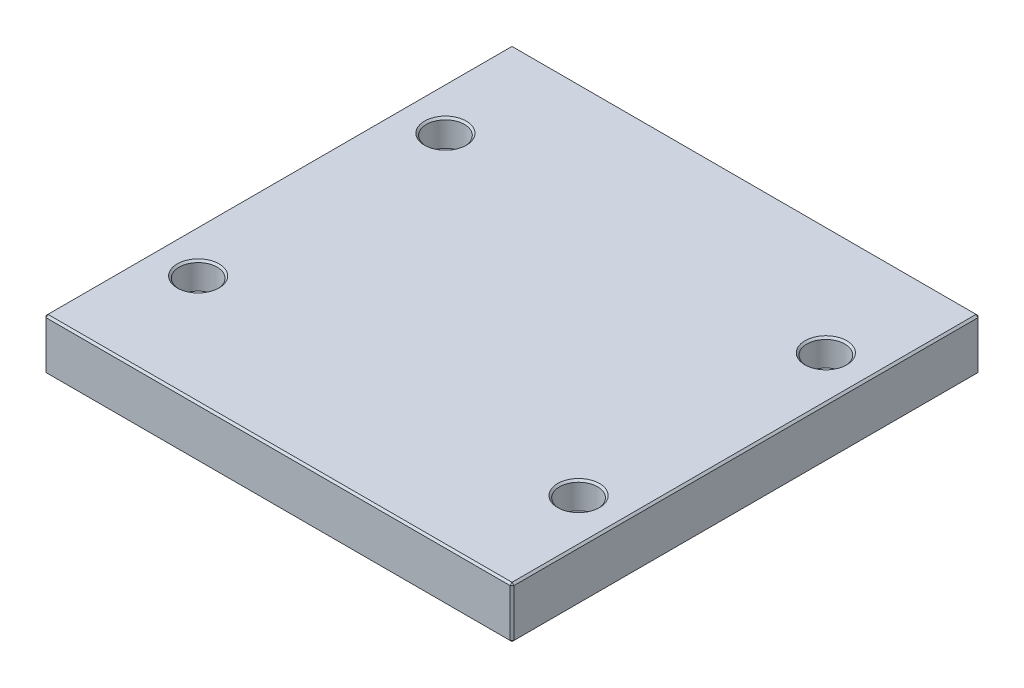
ISO-10303-21;
HEADER;
FILE_DESCRIPTION(('STEP AP214'),'2;1');
FILE_NAME('part.step','',(''),(''),'','','');
FILE_SCHEMA(('AUTOMOTIVE_DESIGN { 1 0 10303 214 1 1 1 1 }'));
ENDSEC;
DATA;
#1=APPLICATION_CONTEXT('core data for automotive mechanical design processes');
#2=APPLICATION_PROTOCOL_DEFINITION('international standard','automotive_design',2000,#1);
#3=PRODUCT_CONTEXT('',#1,'mechanical');
#4=PRODUCT('Part','Part','',(#3));
#5=PRODUCT_RELATED_PRODUCT_CATEGORY('part','',(#4));
#6=PRODUCT_DEFINITION_FORMATION('','',#4);
#7=PRODUCT_DEFINITION_CONTEXT('part definition',#1,'design');
#8=PRODUCT_DEFINITION('design','',#6,#7);
#9=PRODUCT_DEFINITION_SHAPE('','',#8);
#10=(LENGTH_UNIT() NAMED_UNIT(*) SI_UNIT(.MILLI.,.METRE.));
#11=(NAMED_UNIT(*) PLANE_ANGLE_UNIT() SI_UNIT($,.RADIAN.));
#12=(NAMED_UNIT(*) SI_UNIT($,.STERADIAN.) SOLID_ANGLE_UNIT());
#13=UNCERTAINTY_MEASURE_WITH_UNIT(LENGTH_MEASURE(1.E-05),#10,'distance_accuracy_value','');
#14=(GEOMETRIC_REPRESENTATION_CONTEXT(3) GLOBAL_UNCERTAINTY_ASSIGNED_CONTEXT((#13)) GLOBAL_UNIT_ASSIGNED_CONTEXT((#10,
#11,#12)) REPRESENTATION_CONTEXT('',''));
#15=CARTESIAN_POINT('',(0.,0.,0.));
#16=DIRECTION('',(0.,0.,1.));
#17=DIRECTION('',(1.,0.,0.));
#18=AXIS2_PLACEMENT_3D('',#15,#16,#17);
#19=CARTESIAN_POINT('',(-123.,27.,123.));
#20=DIRECTION('',(1.,0.,0.));
#21=DIRECTION('',(0.,0.,-1.));
#22=AXIS2_PLACEMENT_3D('',#19,#20,#21);
#23=PLANE('',#22);
#24=DIRECTION('',(0.,-1.,0.));
#25=VECTOR('',#24,1.);
#26=CARTESIAN_POINT('',(-123.,27.,-122.));
#27=LINE('',#26,#25);
#28=CARTESIAN_POINT('',(-123.,26.,-122.));
#29=VERTEX_POINT('',#28);
#30=CARTESIAN_POINT('',(-123.,1.,-122.));
#31=VERTEX_POINT('',#30);
#32=EDGE_CURVE('E115',#29,#31,#27,.T.);
#33=ORIENTED_EDGE('',*,*,#32,.T.);
#34=DIRECTION('',(0.,0.,1.));
#35=VECTOR('',#34,1.);
#36=CARTESIAN_POINT('',(-123.,1.,123.));
#37=LINE('',#36,#35);
#38=CARTESIAN_POINT('',(-123.,1.,122.));
#39=VERTEX_POINT('',#38);
#40=EDGE_CURVE('E111',#31,#39,#37,.T.);
#41=ORIENTED_EDGE('',*,*,#40,.T.);
#42=DIRECTION('',(0.,1.,0.));
#43=VECTOR('',#42,1.);
#44=CARTESIAN_POINT('',(-123.,27.,122.));
#45=LINE('',#44,#43);
#46=CARTESIAN_POINT('',(-123.,26.,122.));
#47=VERTEX_POINT('',#46);
#48=EDGE_CURVE('E104',#39,#47,#45,.T.);
#49=ORIENTED_EDGE('',*,*,#48,.T.);
#50=DIRECTION('',(0.,0.,-1.));
#51=VECTOR('',#50,1.);
#52=CARTESIAN_POINT('',(-123.,26.,-123.));
#53=LINE('',#52,#51);
#54=EDGE_CURVE('E108',#47,#29,#53,.T.);
#55=ORIENTED_EDGE('',*,*,#54,.T.);
#56=EDGE_LOOP('',(#33,#41,#49,#55));
#57=FACE_BOUND('',#56,.T.);
#58=ADVANCED_FACE('F16',(#57),#23,.F.);
#59=CARTESIAN_POINT('',(123.,27.,123.));
#60=DIRECTION('',(0.,0.,-1.));
#61=DIRECTION('',(-1.,0.,0.));
#62=AXIS2_PLACEMENT_3D('',#59,#60,#61);
#63=PLANE('',#62);
#64=DIRECTION('',(-1.,0.,0.));
#65=VECTOR('',#64,1.);
#66=CARTESIAN_POINT('',(-123.,26.,123.));
#67=LINE('',#66,#65);
#68=CARTESIAN_POINT('',(122.,26.,123.));
#69=VERTEX_POINT('',#68);
#70=CARTESIAN_POINT('',(-122.,26.,123.));
#71=VERTEX_POINT('',#70);
#72=EDGE_CURVE('E170',#69,#71,#67,.T.);
#73=ORIENTED_EDGE('',*,*,#72,.T.);
#74=DIRECTION('',(0.,-1.,0.));
#75=VECTOR('',#74,1.);
#76=CARTESIAN_POINT('',(-122.,27.,123.));
#77=LINE('',#76,#75);
#78=CARTESIAN_POINT('',(-122.,1.,123.));
#79=VERTEX_POINT('',#78);
#80=EDGE_CURVE('E123',#71,#79,#77,.T.);
#81=ORIENTED_EDGE('',*,*,#80,.T.);
#82=DIRECTION('',(1.,0.,0.));
#83=VECTOR('',#82,1.);
#84=CARTESIAN_POINT('',(123.,1.,123.));
#85=LINE('',#84,#83);
#86=CARTESIAN_POINT('',(122.,1.,123.));
#87=VERTEX_POINT('',#86);
#88=EDGE_CURVE('E174',#79,#87,#85,.T.);
#89=ORIENTED_EDGE('',*,*,#88,.T.);
#90=DIRECTION('',(0.,1.,0.));
#91=VECTOR('',#90,1.);
#92=CARTESIAN_POINT('',(122.,27.,123.));
#93=LINE('',#92,#91);
#94=EDGE_CURVE('E172',#87,#69,#93,.T.);
#95=ORIENTED_EDGE('',*,*,#94,.T.);
#96=EDGE_LOOP('',(#73,#81,#89,#95));
#97=FACE_BOUND('',#96,.T.);
#98=ADVANCED_FACE('F317',(#97),#63,.F.);
#99=CARTESIAN_POINT('',(123.,27.,123.));
#100=DIRECTION('',(-1.,0.,0.));
#101=DIRECTION('',(0.,0.,1.));
#102=AXIS2_PLACEMENT_3D('',#99,#100,#101);
#103=PLANE('',#102);
#104=DIRECTION('',(0.,0.,-1.));
#105=VECTOR('',#104,1.);
#106=CARTESIAN_POINT('',(123.,1.,123.));
#107=LINE('',#106,#105);
#108=CARTESIAN_POINT('',(123.,1.,122.));
#109=VERTEX_POINT('',#108);
#110=CARTESIAN_POINT('',(123.,1.,-122.));
#111=VERTEX_POINT('',#110);
#112=EDGE_CURVE('E165',#109,#111,#107,.T.);
#113=ORIENTED_EDGE('',*,*,#112,.T.);
#114=DIRECTION('',(0.,1.,0.));
#115=VECTOR('',#114,1.);
#116=CARTESIAN_POINT('',(123.,27.,-122.));
#117=LINE('',#116,#115);
#118=CARTESIAN_POINT('',(123.,26.,-122.));
#119=VERTEX_POINT('',#118);
#120=EDGE_CURVE('E167',#111,#119,#117,.T.);
#121=ORIENTED_EDGE('',*,*,#120,.T.);
#122=DIRECTION('',(0.,0.,1.));
#123=VECTOR('',#122,1.);
#124=CARTESIAN_POINT('',(123.,26.,123.));
#125=LINE('',#124,#123);
#126=CARTESIAN_POINT('',(123.,26.,122.));
#127=VERTEX_POINT('',#126);
#128=EDGE_CURVE('E161',#119,#127,#125,.T.);
#129=ORIENTED_EDGE('',*,*,#128,.T.);
#130=DIRECTION('',(0.,-1.,0.));
#131=VECTOR('',#130,1.);
#132=CARTESIAN_POINT('',(123.,27.,122.));
#133=LINE('',#132,#131);
#134=EDGE_CURVE('E163',#127,#109,#133,.T.);
#135=ORIENTED_EDGE('',*,*,#134,.T.);
#136=EDGE_LOOP('',(#113,#121,#129,#135));
#137=FACE_BOUND('',#136,.T.);
#138=ADVANCED_FACE('F323',(#137),#103,.F.);
#139=CARTESIAN_POINT('',(123.,27.,-123.));
#140=DIRECTION('',(0.,0.,1.));
#141=DIRECTION('',(1.,0.,0.));
#142=AXIS2_PLACEMENT_3D('',#139,#140,#141);
#143=PLANE('',#142);
#144=DIRECTION('',(0.,-1.,0.));
#145=VECTOR('',#144,1.);
#146=CARTESIAN_POINT('',(122.,27.,-123.));
#147=LINE('',#146,#145);
#148=CARTESIAN_POINT('',(122.,26.,-123.));
#149=VERTEX_POINT('',#148);
#150=CARTESIAN_POINT('',(122.,1.,-123.));
#151=VERTEX_POINT('',#150);
#152=EDGE_CURVE('E154',#149,#151,#147,.T.);
#153=ORIENTED_EDGE('',*,*,#152,.T.);
#154=DIRECTION('',(-1.,0.,0.));
#155=VECTOR('',#154,1.);
#156=CARTESIAN_POINT('',(123.,1.,-123.));
#157=LINE('',#156,#155);
#158=CARTESIAN_POINT('',(-122.,1.,-123.));
#159=VERTEX_POINT('',#158);
#160=EDGE_CURVE('E159',#151,#159,#157,.T.);
#161=ORIENTED_EDGE('',*,*,#160,.T.);
#162=DIRECTION('',(0.,1.,0.));
#163=VECTOR('',#162,1.);
#164=CARTESIAN_POINT('',(-122.,27.,-123.));
#165=LINE('',#164,#163);
#166=CARTESIAN_POINT('',(-122.,26.,-123.));
#167=VERTEX_POINT('',#166);
#168=EDGE_CURVE('E156',#159,#167,#165,.T.);
#169=ORIENTED_EDGE('',*,*,#168,.T.);
#170=DIRECTION('',(1.,0.,0.));
#171=VECTOR('',#170,1.);
#172=CARTESIAN_POINT('',(123.,26.,-123.));
#173=LINE('',#172,#171);
#174=EDGE_CURVE('E152',#167,#149,#173,.T.);
#175=ORIENTED_EDGE('',*,*,#174,.T.);
#176=EDGE_LOOP('',(#153,#161,#169,#175));
#177=FACE_BOUND('',#176,.T.);
#178=ADVANCED_FACE('F465',(#177),#143,.F.);
#179=CARTESIAN_POINT('',(0.,27.,0.));
#180=DIRECTION('',(0.,1.,0.));
#181=DIRECTION('',(0.,0.,1.));
#182=AXIS2_PLACEMENT_3D('',#179,#180,#181);
#183=PLANE('',#182);
#184=CARTESIAN_POINT('',(-100.,27.,65.));
#185=DIRECTION('',(0.,1.,0.));
#186=DIRECTION('',(0.,0.,1.));
#187=AXIS2_PLACEMENT_3D('',#184,#185,#186);
#188=CIRCLE('',#187,11.);
#189=CARTESIAN_POINT('',(-100.,27.,76.));
#190=VERTEX_POINT('',#189);
#191=EDGE_CURVE('E290',#190,#190,#188,.F.);
#192=ORIENTED_EDGE('',*,*,#191,.T.);
#193=EDGE_LOOP('',(#192));
#194=FACE_BOUND('',#193,.T.);
#195=CARTESIAN_POINT('',(100.,27.,65.));
#196=DIRECTION('',(0.,1.,0.));
#197=DIRECTION('',(0.,0.,1.));
#198=AXIS2_PLACEMENT_3D('',#195,#196,#197);
#199=CIRCLE('',#198,11.);
#200=CARTESIAN_POINT('',(100.,27.,76.));
#201=VERTEX_POINT('',#200);
#202=EDGE_CURVE('E287',#201,#201,#199,.F.);
#203=ORIENTED_EDGE('',*,*,#202,.T.);
#204=EDGE_LOOP('',(#203));
#205=FACE_BOUND('',#204,.T.);
#206=CARTESIAN_POINT('',(100.,27.,-65.));
#207=DIRECTION('',(0.,1.,0.));
#208=DIRECTION('',(0.,0.,1.));
#209=AXIS2_PLACEMENT_3D('',#206,#207,#208);
#210=CIRCLE('',#209,11.);
#211=CARTESIAN_POINT('',(100.,27.,-54.));
#212=VERTEX_POINT('',#211);
#213=EDGE_CURVE('E284',#212,#212,#210,.F.);
#214=ORIENTED_EDGE('',*,*,#213,.T.);
#215=EDGE_LOOP('',(#214));
#216=FACE_BOUND('',#215,.T.);
#217=CARTESIAN_POINT('',(-100.,27.,-65.));
#218=DIRECTION('',(0.,1.,0.));
#219=DIRECTION('',(0.,0.,1.));
#220=AXIS2_PLACEMENT_3D('',#217,#218,#219);
#221=CIRCLE('',#220,11.);
#222=CARTESIAN_POINT('',(-100.,27.,-54.));
#223=VERTEX_POINT('',#222);
#224=EDGE_CURVE('E281',#223,#223,#221,.F.);
#225=ORIENTED_EDGE('',*,*,#224,.T.);
#226=EDGE_LOOP('',(#225));
#227=FACE_BOUND('',#226,.T.);
#228=DIRECTION('',(0.,0.,-1.));
#229=VECTOR('',#228,1.);
#230=CARTESIAN_POINT('',(122.,27.,-123.));
#231=LINE('',#230,#229);
#232=CARTESIAN_POINT('',(122.,27.,122.));
#233=VERTEX_POINT('',#232);
#234=CARTESIAN_POINT('',(122.,27.,-122.));
#235=VERTEX_POINT('',#234);
#236=EDGE_CURVE('E31',#233,#235,#231,.T.);
#237=ORIENTED_EDGE('',*,*,#236,.T.);
#238=DIRECTION('',(-1.,0.,0.));
#239=VECTOR('',#238,1.);
#240=CARTESIAN_POINT('',(-123.,27.,-122.));
#241=LINE('',#240,#239);
#242=CARTESIAN_POINT('',(-122.,27.,-122.));
#243=VERTEX_POINT('',#242);
#244=EDGE_CURVE('E190',#235,#243,#241,.T.);
#245=ORIENTED_EDGE('',*,*,#244,.T.);
#246=DIRECTION('',(0.,0.,1.));
#247=VECTOR('',#246,1.);
#248=CARTESIAN_POINT('',(-122.,27.,123.));
#249=LINE('',#248,#247);
#250=CARTESIAN_POINT('',(-122.,27.,122.));
#251=VERTEX_POINT('',#250);
#252=EDGE_CURVE('E186',#243,#251,#249,.T.);
#253=ORIENTED_EDGE('',*,*,#252,.T.);
#254=DIRECTION('',(1.,0.,0.));
#255=VECTOR('',#254,1.);
#256=CARTESIAN_POINT('',(123.,27.,122.));
#257=LINE('',#256,#255);
#258=EDGE_CURVE('E36',#251,#233,#257,.T.);
#259=ORIENTED_EDGE('',*,*,#258,.T.);
#260=EDGE_LOOP('',(#237,#245,#253,#259));
#261=FACE_BOUND('',#260,.T.);
#262=ADVANCED_FACE('F462',(#194,#205,#216,#227,#261),#183,.T.);
#263=CARTESIAN_POINT('',(0.,0.,0.));
#264=DIRECTION('',(0.,1.,0.));
#265=DIRECTION('',(0.,0.,1.));
#266=AXIS2_PLACEMENT_3D('',#263,#264,#265);
#267=PLANE('',#266);
#268=CARTESIAN_POINT('',(100.,0.,-65.));
#269=DIRECTION('',(0.,1.,0.));
#270=DIRECTION('',(0.,0.,1.));
#271=AXIS2_PLACEMENT_3D('',#268,#269,#270);
#272=CIRCLE('',#271,8.);
#273=CARTESIAN_POINT('',(100.,0.,-57.));
#274=VERTEX_POINT('',#273);
#275=EDGE_CURVE('E263',#274,#274,#272,.T.);
#276=ORIENTED_EDGE('',*,*,#275,.T.);
#277=EDGE_LOOP('',(#276));
#278=FACE_BOUND('',#277,.T.);
#279=CARTESIAN_POINT('',(100.,0.,65.));
#280=DIRECTION('',(0.,1.,0.));
#281=DIRECTION('',(0.,0.,1.));
#282=AXIS2_PLACEMENT_3D('',#279,#280,#281);
#283=CIRCLE('',#282,8.);
#284=CARTESIAN_POINT('',(100.,0.,73.));
#285=VERTEX_POINT('',#284);
#286=EDGE_CURVE('E260',#285,#285,#283,.T.);
#287=ORIENTED_EDGE('',*,*,#286,.T.);
#288=EDGE_LOOP('',(#287));
#289=FACE_BOUND('',#288,.T.);
#290=CARTESIAN_POINT('',(-100.,0.,65.));
#291=DIRECTION('',(0.,1.,0.));
#292=DIRECTION('',(0.,0.,1.));
#293=AXIS2_PLACEMENT_3D('',#290,#291,#292);
#294=CIRCLE('',#293,8.);
#295=CARTESIAN_POINT('',(-100.,0.,73.));
#296=VERTEX_POINT('',#295);
#297=EDGE_CURVE('E257',#296,#296,#294,.T.);
#298=ORIENTED_EDGE('',*,*,#297,.T.);
#299=EDGE_LOOP('',(#298));
#300=FACE_BOUND('',#299,.T.);
#301=CARTESIAN_POINT('',(-100.,0.,-65.));
#302=DIRECTION('',(0.,1.,0.));
#303=DIRECTION('',(0.,0.,1.));
#304=AXIS2_PLACEMENT_3D('',#301,#302,#303);
#305=CIRCLE('',#304,8.);
#306=CARTESIAN_POINT('',(-100.,0.,-57.));
#307=VERTEX_POINT('',#306);
#308=EDGE_CURVE('E192',#307,#307,#305,.T.);
#309=ORIENTED_EDGE('',*,*,#308,.T.);
#310=EDGE_LOOP('',(#309));
#311=FACE_BOUND('',#310,.T.);
#312=DIRECTION('',(0.,0.,1.));
#313=VECTOR('',#312,1.);
#314=CARTESIAN_POINT('',(122.,0.,0.));
#315=LINE('',#314,#313);
#316=CARTESIAN_POINT('',(122.,0.,-122.));
#317=VERTEX_POINT('',#316);
#318=CARTESIAN_POINT('',(122.,0.,122.));
#319=VERTEX_POINT('',#318);
#320=EDGE_CURVE('E177',#317,#319,#315,.T.);
#321=ORIENTED_EDGE('',*,*,#320,.T.);
#322=DIRECTION('',(-1.,0.,0.));
#323=VECTOR('',#322,1.);
#324=CARTESIAN_POINT('',(0.,0.,122.));
#325=LINE('',#324,#323);
#326=CARTESIAN_POINT('',(-122.,0.,122.));
#327=VERTEX_POINT('',#326);
#328=EDGE_CURVE('E183',#319,#327,#325,.T.);
#329=ORIENTED_EDGE('',*,*,#328,.T.);
#330=DIRECTION('',(0.,0.,-1.));
#331=VECTOR('',#330,1.);
#332=CARTESIAN_POINT('',(-122.,0.,0.));
#333=LINE('',#332,#331);
#334=CARTESIAN_POINT('',(-122.,0.,-122.));
#335=VERTEX_POINT('',#334);
#336=EDGE_CURVE('E181',#327,#335,#333,.T.);
#337=ORIENTED_EDGE('',*,*,#336,.T.);
#338=DIRECTION('',(1.,0.,0.));
#339=VECTOR('',#338,1.);
#340=CARTESIAN_POINT('',(0.,0.,-122.));
#341=LINE('',#340,#339);
#342=EDGE_CURVE('E179',#335,#317,#341,.T.);
#343=ORIENTED_EDGE('',*,*,#342,.T.);
#344=EDGE_LOOP('',(#321,#329,#337,#343));
#345=FACE_BOUND('',#344,.T.);
#346=ADVANCED_FACE('F402',(#278,#289,#300,#311,#345),#267,.F.);
#347=CARTESIAN_POINT('',(123.,27.,122.));
#348=DIRECTION('',(-0.707106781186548,0.,-0.707106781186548));
#349=DIRECTION('',(0.,-1.,0.));
#350=AXIS2_PLACEMENT_3D('',#347,#348,#349);
#351=PLANE('',#350);
#352=DIRECTION('',(-0.707106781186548,0.,0.707106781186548));
#353=VECTOR('',#352,1.);
#354=CARTESIAN_POINT('',(122.,26.,123.));
#355=LINE('',#354,#353);
#356=EDGE_CURVE('E141',#69,#127,#355,.F.);
#357=ORIENTED_EDGE('',*,*,#356,.F.);
#358=ORIENTED_EDGE('',*,*,#94,.F.);
#359=DIRECTION('',(0.707106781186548,0.,-0.707106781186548));
#360=VECTOR('',#359,1.);
#361=CARTESIAN_POINT('',(122.,1.,123.));
#362=LINE('',#361,#360);
#363=EDGE_CURVE('E144',#109,#87,#362,.F.);
#364=ORIENTED_EDGE('',*,*,#363,.F.);
#365=ORIENTED_EDGE('',*,*,#134,.F.);
#366=EDGE_LOOP('',(#357,#358,#364,#365));
#367=FACE_BOUND('',#366,.T.);
#368=ADVANCED_FACE('F398',(#367),#351,.F.);
#369=CARTESIAN_POINT('',(122.,26.,123.));
#370=DIRECTION('',(0.577350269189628,0.57735026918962,0.577350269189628));
#371=DIRECTION('',(0.707106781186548,0.,-0.707106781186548));
#372=AXIS2_PLACEMENT_3D('',#369,#370,#371);
#373=PLANE('',#372);
#374=DIRECTION('',(0.,-0.70710678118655,0.707106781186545));
#375=VECTOR('',#374,1.);
#376=CARTESIAN_POINT('',(122.,26.,123.));
#377=LINE('',#376,#375);
#378=EDGE_CURVE('E235',#69,#233,#377,.F.);
#379=ORIENTED_EDGE('',*,*,#378,.F.);
#380=ORIENTED_EDGE('',*,*,#356,.T.);
#381=DIRECTION('',(-0.707106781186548,0.707106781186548,0.));
#382=VECTOR('',#381,1.);
#383=CARTESIAN_POINT('',(122.5,26.5,122.));
#384=LINE('',#383,#382);
#385=EDGE_CURVE('E237',#233,#127,#384,.F.);
#386=ORIENTED_EDGE('',*,*,#385,.F.);
#387=EDGE_LOOP('',(#379,#380,#386));
#388=FACE_BOUND('',#387,.T.);
#389=ADVANCED_FACE('F394',(#388),#373,.T.);
#390=CARTESIAN_POINT('',(122.,1.,123.));
#391=DIRECTION('',(0.577350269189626,-0.577350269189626,0.577350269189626));
#392=DIRECTION('',(0.707106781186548,0.,-0.707106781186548));
#393=AXIS2_PLACEMENT_3D('',#390,#391,#392);
#394=PLANE('',#393);
#395=DIRECTION('',(-0.707106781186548,-0.707106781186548,0.));
#396=VECTOR('',#395,1.);
#397=CARTESIAN_POINT('',(122.5,0.5,122.));
#398=LINE('',#397,#396);
#399=EDGE_CURVE('E229',#109,#319,#398,.T.);
#400=ORIENTED_EDGE('',*,*,#399,.F.);
#401=ORIENTED_EDGE('',*,*,#363,.T.);
#402=DIRECTION('',(0.,0.70710678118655,0.707106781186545));
#403=VECTOR('',#402,1.);
#404=CARTESIAN_POINT('',(122.,1.,123.));
#405=LINE('',#404,#403);
#406=EDGE_CURVE('E232',#319,#87,#405,.T.);
#407=ORIENTED_EDGE('',*,*,#406,.F.);
#408=EDGE_LOOP('',(#400,#401,#407));
#409=FACE_BOUND('',#408,.T.);
#410=ADVANCED_FACE('F390',(#409),#394,.T.);
#411=CARTESIAN_POINT('',(122.,27.,0.));
#412=DIRECTION('',(0.707106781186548,0.707106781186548,0.));
#413=DIRECTION('',(0.,0.,1.));
#414=AXIS2_PLACEMENT_3D('',#411,#412,#413);
#415=PLANE('',#414);
#416=ORIENTED_EDGE('',*,*,#385,.T.);
#417=ORIENTED_EDGE('',*,*,#128,.F.);
#418=DIRECTION('',(0.707106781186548,-0.707106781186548,0.));
#419=VECTOR('',#418,1.);
#420=CARTESIAN_POINT('',(123.,26.,-122.));
#421=LINE('',#420,#419);
#422=EDGE_CURVE('E224',#235,#119,#421,.T.);
#423=ORIENTED_EDGE('',*,*,#422,.F.);
#424=ORIENTED_EDGE('',*,*,#236,.F.);
#425=EDGE_LOOP('',(#416,#417,#423,#424));
#426=FACE_BOUND('',#425,.T.);
#427=ADVANCED_FACE('F386',(#426),#415,.T.);
#428=CARTESIAN_POINT('',(0.,27.,122.));
#429=DIRECTION('',(0.,0.707106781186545,0.70710678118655));
#430=DIRECTION('',(-1.,0.,0.));
#431=AXIS2_PLACEMENT_3D('',#428,#429,#430);
#432=PLANE('',#431);
#433=ORIENTED_EDGE('',*,*,#378,.T.);
#434=ORIENTED_EDGE('',*,*,#258,.F.);
#435=DIRECTION('',(0.,0.70710678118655,-0.707106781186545));
#436=VECTOR('',#435,1.);
#437=CARTESIAN_POINT('',(-122.,26.5,122.5));
#438=LINE('',#437,#436);
#439=EDGE_CURVE('E127',#71,#251,#438,.T.);
#440=ORIENTED_EDGE('',*,*,#439,.F.);
#441=ORIENTED_EDGE('',*,*,#72,.F.);
#442=EDGE_LOOP('',(#433,#434,#440,#441));
#443=FACE_BOUND('',#442,.T.);
#444=ADVANCED_FACE('F383',(#443),#432,.T.);
#445=CARTESIAN_POINT('',(-122.,27.,123.));
#446=DIRECTION('',(0.707106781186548,0.,-0.707106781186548));
#447=DIRECTION('',(0.,-1.,0.));
#448=AXIS2_PLACEMENT_3D('',#445,#446,#447);
#449=PLANE('',#448);
#450=DIRECTION('',(0.707106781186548,0.,0.707106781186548));
#451=VECTOR('',#450,1.);
#452=CARTESIAN_POINT('',(-122.,1.,123.));
#453=LINE('',#452,#451);
#454=EDGE_CURVE('E128',#79,#39,#453,.F.);
#455=ORIENTED_EDGE('',*,*,#454,.F.);
#456=ORIENTED_EDGE('',*,*,#80,.F.);
#457=DIRECTION('',(-0.707106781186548,0.,-0.707106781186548));
#458=VECTOR('',#457,1.);
#459=CARTESIAN_POINT('',(-123.,26.,122.));
#460=LINE('',#459,#458);
#461=EDGE_CURVE('E119',#47,#71,#460,.F.);
#462=ORIENTED_EDGE('',*,*,#461,.F.);
#463=ORIENTED_EDGE('',*,*,#48,.F.);
#464=EDGE_LOOP('',(#455,#456,#462,#463));
#465=FACE_BOUND('',#464,.T.);
#466=ADVANCED_FACE('F121',(#465),#449,.F.);
#467=CARTESIAN_POINT('',(123.,1.,123.));
#468=DIRECTION('',(0.,0.707106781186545,-0.70710678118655));
#469=DIRECTION('',(1.,0.,0.));
#470=AXIS2_PLACEMENT_3D('',#467,#468,#469);
#471=PLANE('',#470);
#472=ORIENTED_EDGE('',*,*,#406,.T.);
#473=ORIENTED_EDGE('',*,*,#88,.F.);
#474=DIRECTION('',(0.,-0.70710678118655,-0.707106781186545));
#475=VECTOR('',#474,1.);
#476=CARTESIAN_POINT('',(-122.,1.,123.));
#477=LINE('',#476,#475);
#478=EDGE_CURVE('E220',#327,#79,#477,.F.);
#479=ORIENTED_EDGE('',*,*,#478,.F.);
#480=ORIENTED_EDGE('',*,*,#328,.F.);
#481=EDGE_LOOP('',(#472,#473,#479,#480));
#482=FACE_BOUND('',#481,.T.);
#483=ADVANCED_FACE('F376',(#482),#471,.F.);
#484=CARTESIAN_POINT('',(123.,1.,123.));
#485=DIRECTION('',(-0.707106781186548,0.707106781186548,0.));
#486=DIRECTION('',(0.,0.,-1.));
#487=AXIS2_PLACEMENT_3D('',#484,#485,#486);
#488=PLANE('',#487);
#489=ORIENTED_EDGE('',*,*,#399,.T.);
#490=ORIENTED_EDGE('',*,*,#320,.F.);
#491=DIRECTION('',(0.707106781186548,0.707106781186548,0.));
#492=VECTOR('',#491,1.);
#493=CARTESIAN_POINT('',(122.5,0.499999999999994,-122.));
#494=LINE('',#493,#492);
#495=EDGE_CURVE('E217',#111,#317,#494,.F.);
#496=ORIENTED_EDGE('',*,*,#495,.F.);
#497=ORIENTED_EDGE('',*,*,#112,.F.);
#498=EDGE_LOOP('',(#489,#490,#496,#497));
#499=FACE_BOUND('',#498,.T.);
#500=ADVANCED_FACE('F372',(#499),#488,.F.);
#501=CARTESIAN_POINT('',(122.,27.,-123.));
#502=DIRECTION('',(-0.707106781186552,0.,0.707106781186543));
#503=DIRECTION('',(0.,-1.,0.));
#504=AXIS2_PLACEMENT_3D('',#501,#502,#503);
#505=PLANE('',#504);
#506=DIRECTION('',(0.707106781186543,0.,0.707106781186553));
#507=VECTOR('',#506,1.);
#508=CARTESIAN_POINT('',(123.,26.,-122.));
#509=LINE('',#508,#507);
#510=EDGE_CURVE('E226',#119,#149,#509,.F.);
#511=ORIENTED_EDGE('',*,*,#510,.F.);
#512=ORIENTED_EDGE('',*,*,#120,.F.);
#513=DIRECTION('',(-0.707106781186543,0.,-0.707106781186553));
#514=VECTOR('',#513,1.);
#515=CARTESIAN_POINT('',(122.,1.,-123.));
#516=LINE('',#515,#514);
#517=EDGE_CURVE('E214',#151,#111,#516,.F.);
#518=ORIENTED_EDGE('',*,*,#517,.F.);
#519=ORIENTED_EDGE('',*,*,#152,.F.);
#520=EDGE_LOOP('',(#511,#512,#518,#519));
#521=FACE_BOUND('',#520,.T.);
#522=ADVANCED_FACE('F368',(#521),#505,.F.);
#523=CARTESIAN_POINT('',(123.,26.,-122.));
#524=DIRECTION('',(0.577350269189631,0.577350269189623,-0.577350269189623));
#525=DIRECTION('',(-0.707106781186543,0.,-0.707106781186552));
#526=AXIS2_PLACEMENT_3D('',#523,#524,#525);
#527=PLANE('',#526);
#528=ORIENTED_EDGE('',*,*,#422,.T.);
#529=ORIENTED_EDGE('',*,*,#510,.T.);
#530=DIRECTION('',(0.,0.707106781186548,0.707106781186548));
#531=VECTOR('',#530,1.);
#532=CARTESIAN_POINT('',(122.,26.5,-122.5));
#533=LINE('',#532,#531);
#534=EDGE_CURVE('E135',#235,#149,#533,.F.);
#535=ORIENTED_EDGE('',*,*,#534,.F.);
#536=EDGE_LOOP('',(#528,#529,#535));
#537=FACE_BOUND('',#536,.T.);
#538=ADVANCED_FACE('F365',(#537),#527,.T.);
#539=CARTESIAN_POINT('',(-123.,26.,122.));
#540=DIRECTION('',(-0.577350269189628,0.57735026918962,0.577350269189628));
#541=DIRECTION('',(0.707106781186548,0.,0.707106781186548));
#542=AXIS2_PLACEMENT_3D('',#539,#540,#541);
#543=PLANE('',#542);
#544=ORIENTED_EDGE('',*,*,#461,.T.);
#545=ORIENTED_EDGE('',*,*,#439,.T.);
#546=DIRECTION('',(-0.707106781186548,-0.707106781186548,0.));
#547=VECTOR('',#546,1.);
#548=CARTESIAN_POINT('',(-123.,26.,122.));
#549=LINE('',#548,#547);
#550=EDGE_CURVE('E131',#47,#251,#549,.F.);
#551=ORIENTED_EDGE('',*,*,#550,.F.);
#552=EDGE_LOOP('',(#544,#545,#551));
#553=FACE_BOUND('',#552,.T.);
#554=ADVANCED_FACE('F132',(#553),#543,.T.);
#555=CARTESIAN_POINT('',(-122.,1.,123.));
#556=DIRECTION('',(-0.577350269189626,-0.577350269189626,0.577350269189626));
#557=DIRECTION('',(0.707106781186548,0.,0.707106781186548));
#558=AXIS2_PLACEMENT_3D('',#555,#556,#557);
#559=PLANE('',#558);
#560=ORIENTED_EDGE('',*,*,#478,.T.);
#561=ORIENTED_EDGE('',*,*,#454,.T.);
#562=DIRECTION('',(-0.707106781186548,0.707106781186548,0.));
#563=VECTOR('',#562,1.);
#564=CARTESIAN_POINT('',(-122.5,0.5,122.));
#565=LINE('',#564,#563);
#566=EDGE_CURVE('E136',#327,#39,#565,.T.);
#567=ORIENTED_EDGE('',*,*,#566,.F.);
#568=EDGE_LOOP('',(#560,#561,#567));
#569=FACE_BOUND('',#568,.T.);
#570=ADVANCED_FACE('F358',(#569),#559,.T.);
#571=CARTESIAN_POINT('',(122.,1.,-123.));
#572=DIRECTION('',(0.577350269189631,-0.577350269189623,-0.577350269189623));
#573=DIRECTION('',(-0.707106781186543,0.,-0.707106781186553));
#574=AXIS2_PLACEMENT_3D('',#571,#572,#573);
#575=PLANE('',#574);
#576=ORIENTED_EDGE('',*,*,#517,.T.);
#577=ORIENTED_EDGE('',*,*,#495,.T.);
#578=DIRECTION('',(0.,-0.707106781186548,0.707106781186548));
#579=VECTOR('',#578,1.);
#580=CARTESIAN_POINT('',(122.,1.,-123.));
#581=LINE('',#580,#579);
#582=EDGE_CURVE('E207',#151,#317,#581,.T.);
#583=ORIENTED_EDGE('',*,*,#582,.F.);
#584=EDGE_LOOP('',(#576,#577,#583));
#585=FACE_BOUND('',#584,.T.);
#586=ADVANCED_FACE('F354',(#585),#575,.T.);
#587=CARTESIAN_POINT('',(0.,27.,-122.));
#588=DIRECTION('',(0.,0.707106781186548,-0.707106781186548));
#589=DIRECTION('',(1.,0.,0.));
#590=AXIS2_PLACEMENT_3D('',#587,#588,#589);
#591=PLANE('',#590);
#592=ORIENTED_EDGE('',*,*,#534,.T.);
#593=ORIENTED_EDGE('',*,*,#174,.F.);
#594=DIRECTION('',(0.,-0.707106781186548,-0.707106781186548));
#595=VECTOR('',#594,1.);
#596=CARTESIAN_POINT('',(-122.,26.,-123.));
#597=LINE('',#596,#595);
#598=EDGE_CURVE('E204',#243,#167,#597,.T.);
#599=ORIENTED_EDGE('',*,*,#598,.F.);
#600=ORIENTED_EDGE('',*,*,#244,.F.);
#601=EDGE_LOOP('',(#592,#593,#599,#600));
#602=FACE_BOUND('',#601,.T.);
#603=ADVANCED_FACE('F351',(#602),#591,.T.);
#604=CARTESIAN_POINT('',(-122.,27.,0.));
#605=DIRECTION('',(-0.707106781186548,0.707106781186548,0.));
#606=DIRECTION('',(0.,0.,-1.));
#607=AXIS2_PLACEMENT_3D('',#604,#605,#606);
#608=PLANE('',#607);
#609=ORIENTED_EDGE('',*,*,#550,.T.);
#610=ORIENTED_EDGE('',*,*,#252,.F.);
#611=DIRECTION('',(0.707106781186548,0.707106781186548,0.));
#612=VECTOR('',#611,1.);
#613=CARTESIAN_POINT('',(-122.5,26.5,-122.));
#614=LINE('',#613,#612);
#615=EDGE_CURVE('E139',#29,#243,#614,.T.);
#616=ORIENTED_EDGE('',*,*,#615,.F.);
#617=ORIENTED_EDGE('',*,*,#54,.F.);
#618=EDGE_LOOP('',(#609,#610,#616,#617));
#619=FACE_BOUND('',#618,.T.);
#620=ADVANCED_FACE('F138',(#619),#608,.T.);
#621=CARTESIAN_POINT('',(-123.,1.,123.));
#622=DIRECTION('',(0.707106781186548,0.707106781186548,0.));
#623=DIRECTION('',(0.,0.,1.));
#624=AXIS2_PLACEMENT_3D('',#621,#622,#623);
#625=PLANE('',#624);
#626=ORIENTED_EDGE('',*,*,#566,.T.);
#627=ORIENTED_EDGE('',*,*,#40,.F.);
#628=DIRECTION('',(0.707106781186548,-0.707106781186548,0.));
#629=VECTOR('',#628,1.);
#630=CARTESIAN_POINT('',(-123.,1.,-122.));
#631=LINE('',#630,#629);
#632=EDGE_CURVE('E200',#335,#31,#631,.F.);
#633=ORIENTED_EDGE('',*,*,#632,.F.);
#634=ORIENTED_EDGE('',*,*,#336,.F.);
#635=EDGE_LOOP('',(#626,#627,#633,#634));
#636=FACE_BOUND('',#635,.T.);
#637=ADVANCED_FACE('F344',(#636),#625,.F.);
#638=CARTESIAN_POINT('',(123.,1.,-123.));
#639=DIRECTION('',(0.,0.707106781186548,0.707106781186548));
#640=DIRECTION('',(-1.,0.,0.));
#641=AXIS2_PLACEMENT_3D('',#638,#639,#640);
#642=PLANE('',#641);
#643=ORIENTED_EDGE('',*,*,#582,.T.);
#644=ORIENTED_EDGE('',*,*,#342,.F.);
#645=DIRECTION('',(0.,0.707106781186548,-0.707106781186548));
#646=VECTOR('',#645,1.);
#647=CARTESIAN_POINT('',(-122.,0.5,-122.5));
#648=LINE('',#647,#646);
#649=EDGE_CURVE('E197',#159,#335,#648,.F.);
#650=ORIENTED_EDGE('',*,*,#649,.F.);
#651=ORIENTED_EDGE('',*,*,#160,.F.);
#652=EDGE_LOOP('',(#643,#644,#650,#651));
#653=FACE_BOUND('',#652,.T.);
#654=ADVANCED_FACE('F340',(#653),#642,.F.);
#655=CARTESIAN_POINT('',(-122.,26.,-123.));
#656=DIRECTION('',(-0.577350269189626,0.577350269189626,-0.577350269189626));
#657=DIRECTION('',(-0.707106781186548,0.,0.707106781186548));
#658=AXIS2_PLACEMENT_3D('',#655,#656,#657);
#659=PLANE('',#658);
#660=ORIENTED_EDGE('',*,*,#615,.T.);
#661=ORIENTED_EDGE('',*,*,#598,.T.);
#662=DIRECTION('',(0.707106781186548,0.,-0.707106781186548));
#663=VECTOR('',#662,1.);
#664=CARTESIAN_POINT('',(-122.,26.,-123.));
#665=LINE('',#664,#663);
#666=EDGE_CURVE('E195',#29,#167,#665,.T.);
#667=ORIENTED_EDGE('',*,*,#666,.F.);
#668=EDGE_LOOP('',(#660,#661,#667));
#669=FACE_BOUND('',#668,.T.);
#670=ADVANCED_FACE('F336',(#669),#659,.T.);
#671=CARTESIAN_POINT('',(-123.,1.,-122.));
#672=DIRECTION('',(-0.577350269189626,-0.577350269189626,-0.577350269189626));
#673=DIRECTION('',(-0.707106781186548,0.,0.707106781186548));
#674=AXIS2_PLACEMENT_3D('',#671,#672,#673);
#675=PLANE('',#674);
#676=ORIENTED_EDGE('',*,*,#649,.T.);
#677=ORIENTED_EDGE('',*,*,#632,.T.);
#678=DIRECTION('',(-0.707106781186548,0.,0.707106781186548));
#679=VECTOR('',#678,1.);
#680=CARTESIAN_POINT('',(-123.,1.,-122.));
#681=LINE('',#680,#679);
#682=EDGE_CURVE('E193',#159,#31,#681,.T.);
#683=ORIENTED_EDGE('',*,*,#682,.F.);
#684=EDGE_LOOP('',(#676,#677,#683));
#685=FACE_BOUND('',#684,.T.);
#686=ADVANCED_FACE('F332',(#685),#675,.T.);
#687=CARTESIAN_POINT('',(-123.,27.,-122.));
#688=DIRECTION('',(0.707106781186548,0.,0.707106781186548));
#689=DIRECTION('',(0.,-1.,0.));
#690=AXIS2_PLACEMENT_3D('',#687,#688,#689);
#691=PLANE('',#690);
#692=ORIENTED_EDGE('',*,*,#666,.T.);
#693=ORIENTED_EDGE('',*,*,#168,.F.);
#694=ORIENTED_EDGE('',*,*,#682,.T.);
#695=ORIENTED_EDGE('',*,*,#32,.F.);
#696=EDGE_LOOP('',(#692,#693,#694,#695));
#697=FACE_BOUND('',#696,.T.);
#698=ADVANCED_FACE('F328',(#697),#691,.F.);
#699=CARTESIAN_POINT('',(-100.,13.,-65.));
#700=DIRECTION('',(0.,1.,0.));
#701=DIRECTION('',(0.,0.,1.));
#702=AXIS2_PLACEMENT_3D('',#699,#700,#701);
#703=CYLINDRICAL_SURFACE('',#702,10.);
#704=CARTESIAN_POINT('',(-100.,26.,-65.));
#705=DIRECTION('',(0.,1.,0.));
#706=DIRECTION('',(0.,0.,1.));
#707=AXIS2_PLACEMENT_3D('',#704,#705,#706);
#708=CIRCLE('',#707,10.);
#709=CARTESIAN_POINT('',(-100.,26.,-55.));
#710=VERTEX_POINT('',#709);
#711=EDGE_CURVE('E10',#710,#710,#708,.T.);
#712=ORIENTED_EDGE('',*,*,#711,.T.);
#713=EDGE_LOOP('',(#712));
#714=FACE_BOUND('',#713,.T.);
#715=CARTESIAN_POINT('',(-100.,13.,-65.));
#716=DIRECTION('',(0.,1.,0.));
#717=DIRECTION('',(0.,0.,1.));
#718=AXIS2_PLACEMENT_3D('',#715,#716,#717);
#719=CIRCLE('',#718,10.);
#720=CARTESIAN_POINT('',(-100.,13.,-55.));
#721=VERTEX_POINT('',#720);
#722=EDGE_CURVE('E147',#721,#721,#719,.T.);
#723=ORIENTED_EDGE('',*,*,#722,.F.);
#724=EDGE_LOOP('',(#723));
#725=FACE_BOUND('',#724,.T.);
#726=ADVANCED_FACE('F331',(#714,#725),#703,.F.);
#727=CARTESIAN_POINT('',(-100.,13.,-65.));
#728=DIRECTION('',(0.,1.,0.));
#729=DIRECTION('',(0.,0.,1.));
#730=AXIS2_PLACEMENT_3D('',#727,#728,#729);
#731=PLANE('',#730);
#732=CARTESIAN_POINT('',(-100.,13.,-65.));
#733=DIRECTION('',(0.,1.,0.));
#734=DIRECTION('',(0.,0.,1.));
#735=AXIS2_PLACEMENT_3D('',#732,#733,#734);
#736=CIRCLE('',#735,7.);
#737=CARTESIAN_POINT('',(-100.,13.,-58.));
#738=VERTEX_POINT('',#737);
#739=EDGE_CURVE('E251',#738,#738,#736,.T.);
#740=ORIENTED_EDGE('',*,*,#739,.F.);
#741=EDGE_LOOP('',(#740));
#742=FACE_BOUND('',#741,.T.);
#743=ORIENTED_EDGE('',*,*,#722,.T.);
#744=EDGE_LOOP('',(#743));
#745=FACE_BOUND('',#744,.T.);
#746=ADVANCED_FACE('F450',(#742,#745),#731,.T.);
#747=CARTESIAN_POINT('',(100.,13.,-65.));
#748=DIRECTION('',(0.,1.,0.));
#749=DIRECTION('',(0.,0.,1.));
#750=AXIS2_PLACEMENT_3D('',#747,#748,#749);
#751=CYLINDRICAL_SURFACE('',#750,10.);
#752=CARTESIAN_POINT('',(100.,26.,-65.));
#753=DIRECTION('',(0.,1.,0.));
#754=DIRECTION('',(0.,0.,1.));
#755=AXIS2_PLACEMENT_3D('',#752,#753,#754);
#756=CIRCLE('',#755,10.);
#757=CARTESIAN_POINT('',(100.,26.,-55.));
#758=VERTEX_POINT('',#757);
#759=EDGE_CURVE('E24',#758,#758,#756,.T.);
#760=ORIENTED_EDGE('',*,*,#759,.T.);
#761=EDGE_LOOP('',(#760));
#762=FACE_BOUND('',#761,.T.);
#763=CARTESIAN_POINT('',(100.,13.,-65.));
#764=DIRECTION('',(0.,1.,0.));
#765=DIRECTION('',(0.,0.,1.));
#766=AXIS2_PLACEMENT_3D('',#763,#764,#765);
#767=CIRCLE('',#766,10.);
#768=CARTESIAN_POINT('',(100.,13.,-55.));
#769=VERTEX_POINT('',#768);
#770=EDGE_CURVE('E441',#769,#769,#767,.T.);
#771=ORIENTED_EDGE('',*,*,#770,.F.);
#772=EDGE_LOOP('',(#771));
#773=FACE_BOUND('',#772,.T.);
#774=ADVANCED_FACE('F298',(#762,#773),#751,.F.);
#775=CARTESIAN_POINT('',(100.,13.,-65.));
#776=DIRECTION('',(0.,1.,0.));
#777=DIRECTION('',(0.,0.,1.));
#778=AXIS2_PLACEMENT_3D('',#775,#776,#777);
#779=PLANE('',#778);
#780=CARTESIAN_POINT('',(100.,13.,-65.));
#781=DIRECTION('',(0.,1.,0.));
#782=DIRECTION('',(0.,0.,1.));
#783=AXIS2_PLACEMENT_3D('',#780,#781,#782);
#784=CIRCLE('',#783,7.);
#785=CARTESIAN_POINT('',(100.,13.,-58.));
#786=VERTEX_POINT('',#785);
#787=EDGE_CURVE('E248',#786,#786,#784,.T.);
#788=ORIENTED_EDGE('',*,*,#787,.F.);
#789=EDGE_LOOP('',(#788));
#790=FACE_BOUND('',#789,.T.);
#791=ORIENTED_EDGE('',*,*,#770,.T.);
#792=EDGE_LOOP('',(#791));
#793=FACE_BOUND('',#792,.T.);
#794=ADVANCED_FACE('F738',(#790,#793),#779,.T.);
#795=CARTESIAN_POINT('',(100.,13.,65.));
#796=DIRECTION('',(0.,1.,0.));
#797=DIRECTION('',(0.,0.,1.));
#798=AXIS2_PLACEMENT_3D('',#795,#796,#797);
#799=CYLINDRICAL_SURFACE('',#798,10.);
#800=CARTESIAN_POINT('',(100.,26.,65.));
#801=DIRECTION('',(0.,1.,0.));
#802=DIRECTION('',(0.,0.,1.));
#803=AXIS2_PLACEMENT_3D('',#800,#801,#802);
#804=CIRCLE('',#803,10.);
#805=CARTESIAN_POINT('',(100.,26.,75.));
#806=VERTEX_POINT('',#805);
#807=EDGE_CURVE('E293',#806,#806,#804,.T.);
#808=ORIENTED_EDGE('',*,*,#807,.T.);
#809=EDGE_LOOP('',(#808));
#810=FACE_BOUND('',#809,.T.);
#811=CARTESIAN_POINT('',(100.,13.,65.));
#812=DIRECTION('',(0.,1.,0.));
#813=DIRECTION('',(0.,0.,1.));
#814=AXIS2_PLACEMENT_3D('',#811,#812,#813);
#815=CIRCLE('',#814,10.);
#816=CARTESIAN_POINT('',(100.,13.,75.));
#817=VERTEX_POINT('',#816);
#818=EDGE_CURVE('E439',#817,#817,#815,.T.);
#819=ORIENTED_EDGE('',*,*,#818,.F.);
#820=EDGE_LOOP('',(#819));
#821=FACE_BOUND('',#820,.T.);
#822=ADVANCED_FACE('F730',(#810,#821),#799,.F.);
#823=CARTESIAN_POINT('',(100.,13.,65.));
#824=DIRECTION('',(0.,1.,0.));
#825=DIRECTION('',(0.,0.,1.));
#826=AXIS2_PLACEMENT_3D('',#823,#824,#825);
#827=PLANE('',#826);
#828=CARTESIAN_POINT('',(100.,13.,65.));
#829=DIRECTION('',(0.,1.,0.));
#830=DIRECTION('',(0.,0.,1.));
#831=AXIS2_PLACEMENT_3D('',#828,#829,#830);
#832=CIRCLE('',#831,7.);
#833=CARTESIAN_POINT('',(100.,13.,72.));
#834=VERTEX_POINT('',#833);
#835=EDGE_CURVE('E245',#834,#834,#832,.T.);
#836=ORIENTED_EDGE('',*,*,#835,.F.);
#837=EDGE_LOOP('',(#836));
#838=FACE_BOUND('',#837,.T.);
#839=ORIENTED_EDGE('',*,*,#818,.T.);
#840=EDGE_LOOP('',(#839));
#841=FACE_BOUND('',#840,.T.);
#842=ADVANCED_FACE('F434',(#838,#841),#827,.T.);
#843=CARTESIAN_POINT('',(-100.,13.,65.));
#844=DIRECTION('',(0.,1.,0.));
#845=DIRECTION('',(0.,0.,1.));
#846=AXIS2_PLACEMENT_3D('',#843,#844,#845);
#847=CYLINDRICAL_SURFACE('',#846,10.);
#848=CARTESIAN_POINT('',(-100.,26.,65.));
#849=DIRECTION('',(0.,1.,0.));
#850=DIRECTION('',(0.,0.,1.));
#851=AXIS2_PLACEMENT_3D('',#848,#849,#850);
#852=CIRCLE('',#851,10.);
#853=CARTESIAN_POINT('',(-100.,26.,75.));
#854=VERTEX_POINT('',#853);
#855=EDGE_CURVE('E278',#854,#854,#852,.T.);
#856=ORIENTED_EDGE('',*,*,#855,.T.);
#857=EDGE_LOOP('',(#856));
#858=FACE_BOUND('',#857,.T.);
#859=CARTESIAN_POINT('',(-100.,13.,65.));
#860=DIRECTION('',(0.,1.,0.));
#861=DIRECTION('',(0.,0.,1.));
#862=AXIS2_PLACEMENT_3D('',#859,#860,#861);
#863=CIRCLE('',#862,10.);
#864=CARTESIAN_POINT('',(-100.,13.,75.));
#865=VERTEX_POINT('',#864);
#866=EDGE_CURVE('E254',#865,#865,#863,.T.);
#867=ORIENTED_EDGE('',*,*,#866,.F.);
#868=EDGE_LOOP('',(#867));
#869=FACE_BOUND('',#868,.T.);
#870=ADVANCED_FACE('F430',(#858,#869),#847,.F.);
#871=CARTESIAN_POINT('',(-100.,13.,65.));
#872=DIRECTION('',(0.,1.,0.));
#873=DIRECTION('',(0.,0.,1.));
#874=AXIS2_PLACEMENT_3D('',#871,#872,#873);
#875=PLANE('',#874);
#876=CARTESIAN_POINT('',(-100.,13.,65.));
#877=DIRECTION('',(0.,1.,0.));
#878=DIRECTION('',(0.,0.,1.));
#879=AXIS2_PLACEMENT_3D('',#876,#877,#878);
#880=CIRCLE('',#879,7.);
#881=CARTESIAN_POINT('',(-100.,13.,72.));
#882=VERTEX_POINT('',#881);
#883=EDGE_CURVE('E242',#882,#882,#880,.T.);
#884=ORIENTED_EDGE('',*,*,#883,.F.);
#885=EDGE_LOOP('',(#884));
#886=FACE_BOUND('',#885,.T.);
#887=ORIENTED_EDGE('',*,*,#866,.T.);
#888=EDGE_LOOP('',(#887));
#889=FACE_BOUND('',#888,.T.);
#890=ADVANCED_FACE('F433',(#886,#889),#875,.T.);
#891=CARTESIAN_POINT('',(-100.,0.,65.));
#892=DIRECTION('',(0.,1.,0.));
#893=DIRECTION('',(0.,0.,1.));
#894=AXIS2_PLACEMENT_3D('',#891,#892,#893);
#895=CYLINDRICAL_SURFACE('',#894,7.);
#896=CARTESIAN_POINT('',(-100.,1.00000000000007,65.));
#897=DIRECTION('',(0.,1.,0.));
#898=DIRECTION('',(0.,0.,1.));
#899=AXIS2_PLACEMENT_3D('',#896,#897,#898);
#900=CIRCLE('',#899,7.);
#901=CARTESIAN_POINT('',(-100.,1.00000000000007,72.));
#902=VERTEX_POINT('',#901);
#903=EDGE_CURVE('E272',#902,#902,#900,.F.);
#904=ORIENTED_EDGE('',*,*,#903,.T.);
#905=EDGE_LOOP('',(#904));
#906=FACE_BOUND('',#905,.T.);
#907=ORIENTED_EDGE('',*,*,#883,.T.);
#908=EDGE_LOOP('',(#907));
#909=FACE_BOUND('',#908,.T.);
#910=ADVANCED_FACE('F705',(#906,#909),#895,.F.);
#911=CARTESIAN_POINT('',(100.,0.,65.));
#912=DIRECTION('',(0.,1.,0.));
#913=DIRECTION('',(0.,0.,1.));
#914=AXIS2_PLACEMENT_3D('',#911,#912,#913);
#915=CYLINDRICAL_SURFACE('',#914,7.);
#916=CARTESIAN_POINT('',(100.,1.00000000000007,65.));
#917=DIRECTION('',(0.,1.,0.));
#918=DIRECTION('',(0.,0.,1.));
#919=AXIS2_PLACEMENT_3D('',#916,#917,#918);
#920=CIRCLE('',#919,7.);
#921=CARTESIAN_POINT('',(100.,1.00000000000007,72.));
#922=VERTEX_POINT('',#921);
#923=EDGE_CURVE('E269',#922,#922,#920,.F.);
#924=ORIENTED_EDGE('',*,*,#923,.T.);
#925=EDGE_LOOP('',(#924));
#926=FACE_BOUND('',#925,.T.);
#927=ORIENTED_EDGE('',*,*,#835,.T.);
#928=EDGE_LOOP('',(#927));
#929=FACE_BOUND('',#928,.T.);
#930=ADVANCED_FACE('F697',(#926,#929),#915,.F.);
#931=CARTESIAN_POINT('',(100.,0.,-65.));
#932=DIRECTION('',(0.,1.,0.));
#933=DIRECTION('',(0.,0.,1.));
#934=AXIS2_PLACEMENT_3D('',#931,#932,#933);
#935=CYLINDRICAL_SURFACE('',#934,7.);
#936=CARTESIAN_POINT('',(100.,0.999999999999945,-65.));
#937=DIRECTION('',(0.,1.,0.));
#938=DIRECTION('',(0.,0.,1.));
#939=AXIS2_PLACEMENT_3D('',#936,#937,#938);
#940=CIRCLE('',#939,7.);
#941=CARTESIAN_POINT('',(100.,0.999999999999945,-58.));
#942=VERTEX_POINT('',#941);
#943=EDGE_CURVE('E266',#942,#942,#940,.F.);
#944=ORIENTED_EDGE('',*,*,#943,.T.);
#945=EDGE_LOOP('',(#944));
#946=FACE_BOUND('',#945,.T.);
#947=ORIENTED_EDGE('',*,*,#787,.T.);
#948=EDGE_LOOP('',(#947));
#949=FACE_BOUND('',#948,.T.);
#950=ADVANCED_FACE('F688',(#946,#949),#935,.F.);
#951=CARTESIAN_POINT('',(-100.,0.,-65.));
#952=DIRECTION('',(0.,1.,0.));
#953=DIRECTION('',(0.,0.,1.));
#954=AXIS2_PLACEMENT_3D('',#951,#952,#953);
#955=CYLINDRICAL_SURFACE('',#954,7.);
#956=CARTESIAN_POINT('',(-100.,0.999999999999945,-65.));
#957=DIRECTION('',(0.,1.,0.));
#958=DIRECTION('',(0.,0.,1.));
#959=AXIS2_PLACEMENT_3D('',#956,#957,#958);
#960=CIRCLE('',#959,7.);
#961=CARTESIAN_POINT('',(-100.,0.999999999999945,-58.));
#962=VERTEX_POINT('',#961);
#963=EDGE_CURVE('E275',#962,#962,#960,.F.);
#964=ORIENTED_EDGE('',*,*,#963,.T.);
#965=EDGE_LOOP('',(#964));
#966=FACE_BOUND('',#965,.T.);
#967=ORIENTED_EDGE('',*,*,#739,.T.);
#968=EDGE_LOOP('',(#967));
#969=FACE_BOUND('',#968,.T.);
#970=ADVANCED_FACE('F408',(#966,#969),#955,.F.);
#971=CARTESIAN_POINT('',(100.,0.,-65.));
#972=DIRECTION('',(0.,-1.,0.));
#973=DIRECTION('',(0.,0.,-1.));
#974=AXIS2_PLACEMENT_3D('',#971,#972,#973);
#975=CONICAL_SURFACE('',#974,8.,0.78539816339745);
#976=ORIENTED_EDGE('',*,*,#943,.F.);
#977=EDGE_LOOP('',(#976));
#978=FACE_BOUND('',#977,.T.);
#979=ORIENTED_EDGE('',*,*,#275,.F.);
#980=EDGE_LOOP('',(#979));
#981=FACE_BOUND('',#980,.T.);
#982=ADVANCED_FACE('F404',(#978,#981),#975,.F.);
#983=CARTESIAN_POINT('',(100.,0.,65.));
#984=DIRECTION('',(0.,-1.,0.));
#985=DIRECTION('',(0.,0.,-1.));
#986=AXIS2_PLACEMENT_3D('',#983,#984,#985);
#987=CONICAL_SURFACE('',#986,8.,0.785398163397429);
#988=ORIENTED_EDGE('',*,*,#923,.F.);
#989=EDGE_LOOP('',(#988));
#990=FACE_BOUND('',#989,.T.);
#991=ORIENTED_EDGE('',*,*,#286,.F.);
#992=EDGE_LOOP('',(#991));
#993=FACE_BOUND('',#992,.T.);
#994=ADVANCED_FACE('F407',(#990,#993),#987,.F.);
#995=CARTESIAN_POINT('',(-100.,0.,65.));
#996=DIRECTION('',(0.,-1.,0.));
#997=DIRECTION('',(0.,0.,-1.));
#998=AXIS2_PLACEMENT_3D('',#995,#996,#997);
#999=CONICAL_SURFACE('',#998,8.,0.785398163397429);
#1000=ORIENTED_EDGE('',*,*,#903,.F.);
#1001=EDGE_LOOP('',(#1000));
#1002=FACE_BOUND('',#1001,.T.);
#1003=ORIENTED_EDGE('',*,*,#297,.F.);
#1004=EDGE_LOOP('',(#1003));
#1005=FACE_BOUND('',#1004,.T.);
#1006=ADVANCED_FACE('F412',(#1002,#1005),#999,.F.);
#1007=CARTESIAN_POINT('',(-100.,0.,-65.));
#1008=DIRECTION('',(0.,-1.,0.));
#1009=DIRECTION('',(0.,0.,-1.));
#1010=AXIS2_PLACEMENT_3D('',#1007,#1008,#1009);
#1011=CONICAL_SURFACE('',#1010,8.,0.78539816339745);
#1012=ORIENTED_EDGE('',*,*,#963,.F.);
#1013=EDGE_LOOP('',(#1012));
#1014=FACE_BOUND('',#1013,.T.);
#1015=ORIENTED_EDGE('',*,*,#308,.F.);
#1016=EDGE_LOOP('',(#1015));
#1017=FACE_BOUND('',#1016,.T.);
#1018=ADVANCED_FACE('F416',(#1014,#1017),#1011,.F.);
#1019=CARTESIAN_POINT('',(-100.,26.,65.));
#1020=DIRECTION('',(0.,1.,0.));
#1021=DIRECTION('',(0.,0.,1.));
#1022=AXIS2_PLACEMENT_3D('',#1019,#1020,#1021);
#1023=CONICAL_SURFACE('',#1022,10.,0.785398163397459);
#1024=ORIENTED_EDGE('',*,*,#191,.F.);
#1025=EDGE_LOOP('',(#1024));
#1026=FACE_BOUND('',#1025,.T.);
#1027=ORIENTED_EDGE('',*,*,#855,.F.);
#1028=EDGE_LOOP('',(#1027));
#1029=FACE_BOUND('',#1028,.T.);
#1030=ADVANCED_FACE('F312',(#1026,#1029),#1023,.F.);
#1031=CARTESIAN_POINT('',(100.,26.,65.));
#1032=DIRECTION('',(0.,1.,0.));
#1033=DIRECTION('',(0.,0.,1.));
#1034=AXIS2_PLACEMENT_3D('',#1031,#1032,#1033);
#1035=CONICAL_SURFACE('',#1034,10.,0.785398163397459);
#1036=ORIENTED_EDGE('',*,*,#202,.F.);
#1037=EDGE_LOOP('',(#1036));
#1038=FACE_BOUND('',#1037,.T.);
#1039=ORIENTED_EDGE('',*,*,#807,.F.);
#1040=EDGE_LOOP('',(#1039));
#1041=FACE_BOUND('',#1040,.T.);
#1042=ADVANCED_FACE('F303',(#1038,#1041),#1035,.F.);
#1043=CARTESIAN_POINT('',(100.,26.,-65.));
#1044=DIRECTION('',(0.,1.,0.));
#1045=DIRECTION('',(0.,0.,1.));
#1046=AXIS2_PLACEMENT_3D('',#1043,#1044,#1045);
#1047=CONICAL_SURFACE('',#1046,10.,0.78539816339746);
#1048=ORIENTED_EDGE('',*,*,#213,.F.);
#1049=EDGE_LOOP('',(#1048));
#1050=FACE_BOUND('',#1049,.T.);
#1051=ORIENTED_EDGE('',*,*,#759,.F.);
#1052=EDGE_LOOP('',(#1051));
#1053=FACE_BOUND('',#1052,.T.);
#1054=ADVANCED_FACE('F301',(#1050,#1053),#1047,.F.);
#1055=CARTESIAN_POINT('',(-100.,26.,-65.));
#1056=DIRECTION('',(0.,1.,0.));
#1057=DIRECTION('',(0.,0.,1.));
#1058=AXIS2_PLACEMENT_3D('',#1055,#1056,#1057);
#1059=CONICAL_SURFACE('',#1058,10.,0.78539816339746);
#1060=ORIENTED_EDGE('',*,*,#224,.F.);
#1061=EDGE_LOOP('',(#1060));
#1062=FACE_BOUND('',#1061,.T.);
#1063=ORIENTED_EDGE('',*,*,#711,.F.);
#1064=EDGE_LOOP('',(#1063));
#1065=FACE_BOUND('',#1064,.T.);
#1066=ADVANCED_FACE('F18',(#1062,#1065),#1059,.F.);
#1067=CLOSED_SHELL('',(#58,#98,#138,#178,#262,#346,#368,#389,#410,#427,#444,#466,#483,#500,#522,
#538,#554,#570,#586,#603,#620,#637,#654,#670,#686,#698,#726,#746,#774,#794,#822,#842,#870,#890,
#910,#930,#950,#970,#982,#994,#1006,#1018,#1030,#1042,#1054,#1066));
#1068=MANIFOLD_SOLID_BREP('B1',#1067);
#1069=ADVANCED_BREP_SHAPE_REPRESENTATION('',(#18,#1068),#14);
#1070=SHAPE_DEFINITION_REPRESENTATION(#9,#1069);
ENDSEC;
END-ISO-10303-21;
